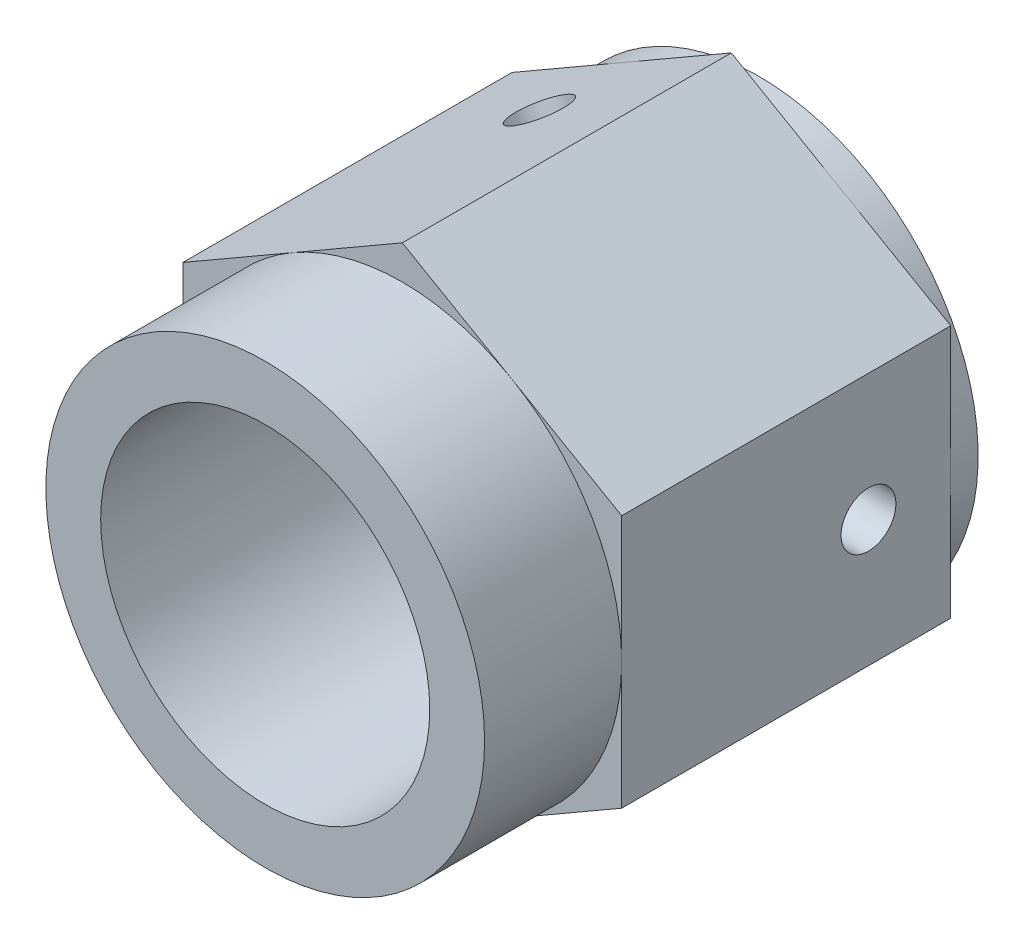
from build123d import *

# Parameters (mm, degrees)
EXTRUDE_1_DEPTH     = 60
SKETCH_2_R          = 40
EXTRUDE_2_DEPTH     = 25
EXTRUDE_START       = 5
SKETCH_3_R          = 40
EXTRUDE_3_DEPTH     = 5
SKETCH_4_R          = 15
CUT_EXTRUDE_1_DEPTH = 45
SKETCH_5_R          = 30
CUT_EXTRUDE_2_DEPTH = 45
SKETCH_6_R          = 5
CUT_EXTRUDE_3_DEPTH = 30
SKETCH_7_R          = 5
CUT_EXTRUDE_4_DEPTH = 30
SKETCH_8_R          = 5
CUT_EXTRUDE_5_DEPTH = 30


with BuildPart() as part:
    # Sketch 1 → Extrude 1 (new body)
    with BuildSketch(Plane.XY):
        Polygon((0, 46.188021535), (-40, 23.094010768), (-40, -23.094010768), (0, -46.188021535), (40, -23.094010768), (40, 23.094010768), align=None)
    extrude(amount=EXTRUDE_1_DEPTH)

    # Sketch 2 → Extrude 2 (add)
    with BuildSketch(Plane.XY.offset(60)):
        Circle(SKETCH_2_R)
    extrude(amount=EXTRUDE_2_DEPTH)

    # Sketch 3 → Extrude 3 (add)
    with BuildSketch(Plane(origin=(0, 0, 0), x_dir=(-1, 0, 0), z_dir=(0, 0, -1)).offset(EXTRUDE_START)):
        with Locations(Location((0, 0, 0), (0, 0, 180))):
            Circle(SKETCH_3_R)
    extrude(amount=-EXTRUDE_3_DEPTH)

    # Sketch 4 → Cut-Extrude 1 (cut)
    with BuildSketch(Plane(origin=(0, 0, -5), x_dir=(-1, 0, 0), z_dir=(0, 0, -1))):
        Circle(SKETCH_4_R)
    extrude(amount=-CUT_EXTRUDE_1_DEPTH, mode=Mode.SUBTRACT)

    # Sketch 5 → Cut-Extrude 2 (cut)
    with BuildSketch(Plane.XY.offset(85)):
        Circle(SKETCH_5_R)
    extrude(amount=-CUT_EXTRUDE_2_DEPTH, mode=Mode.SUBTRACT)

    # Sketch 6 → Cut-Extrude 3 (cut)
    with BuildSketch(Plane(origin=(-20, 34.641016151, 0), x_dir=(0.8660254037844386, 0.5000000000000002, 0), z_dir=(-0.5000000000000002, 0.8660254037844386, 0))):
        with Locations(Location((0, -15, 0), (0, 0, 180))):
            Circle(SKETCH_6_R)
    extrude(amount=-CUT_EXTRUDE_3_DEPTH, mode=Mode.SUBTRACT)

    # Sketch 7 → Cut-Extrude 4 (cut)
    with BuildSketch(Plane(origin=(-20, -34.641016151, 0), x_dir=(0.8660254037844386, -0.5000000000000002, 0), z_dir=(-0.5000000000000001, -0.8660254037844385, 0))):
        with Locations((0, 15)):
            Circle(SKETCH_7_R)
    extrude(amount=-CUT_EXTRUDE_4_DEPTH, mode=Mode.SUBTRACT)

    # Sketch 8 → Cut-Extrude 5 (cut)
    with BuildSketch(Plane(origin=(40, 0, 0), x_dir=(0, 0, -1), z_dir=(1, 0, 0))):
        with Locations((-15, 0)):
            Circle(SKETCH_8_R)
    extrude(amount=-CUT_EXTRUDE_5_DEPTH, mode=Mode.SUBTRACT)


solid = part.part
